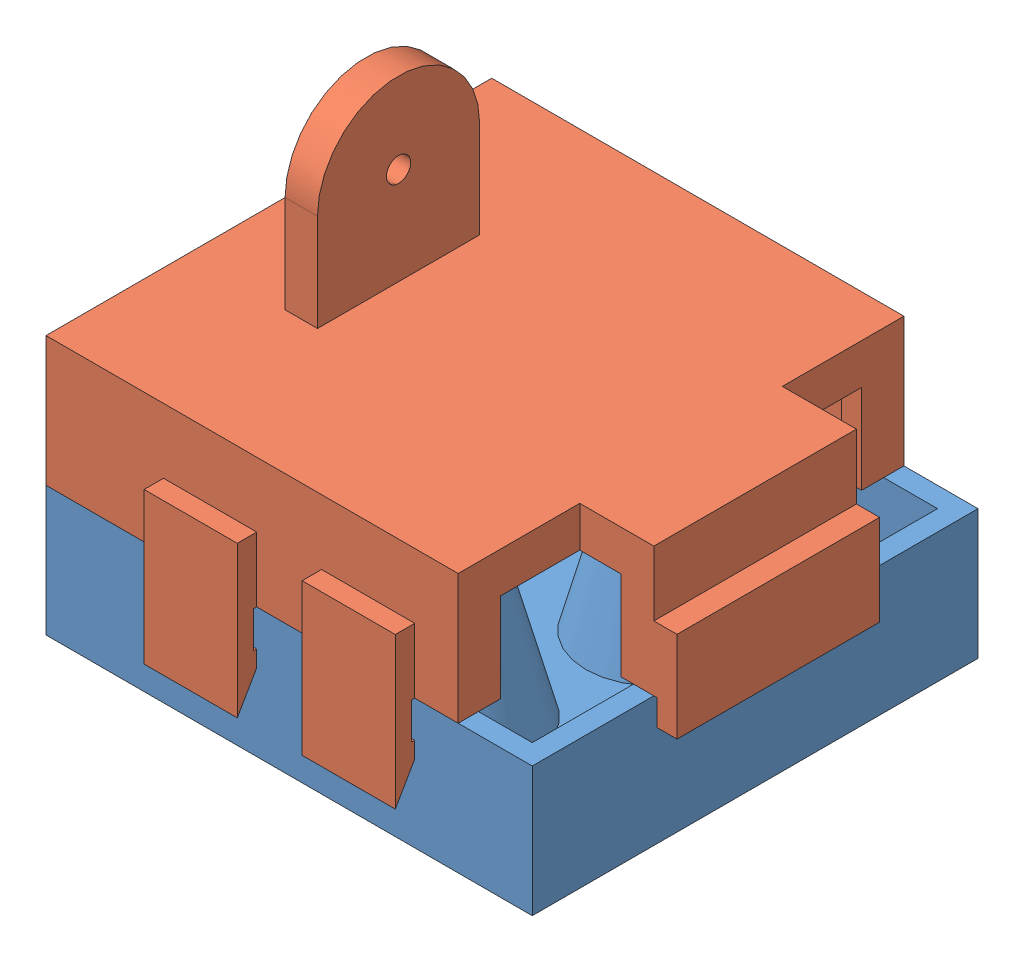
SolidWorks assembly UltrasonicSensorBox.SLDASM, configuration Default (file format 9000). Lengths in mm.
Overall size (62.86 54 59.8).
2 component instances, 2 part files, 3 mates.
Components (placement in the parent):
- BottomBox-1: BottomBox.SLDPRT [Default] at (-34.1 -32.6165 42.4341) size (60 24.5 56)
- TopCover-1: TopCover.sldprt [Default] at (2.5 -3.1165 -2.5) x (0 0 -1) z (1 0 0) size (59.8 48.66 62.86)
Mates (geometry in assembly coordinates):
- Coincident4: coincident aligned: plane of BottomBox-1 through (-60.4578 -30.1165 1.2281) normal (0 0 -1); plane of TopCover-1 through (-60.4578 -0.6165 1.2281) normal (0 0 -1)
- Coincident5: coincident aligned: plane of BottomBox-1 through (-60.4578 -30.1165 1.2281) normal (-1 0 0); plane of TopCover-1 through (-60.4578 -0.6165 56.2281) normal (-1 0 0)
- Coincident6: coincident anti-aligned: plane of BottomBox-1 through (-34.1 -16.6165 42.4341) normal (0 1 0); plane of TopCover-1 through (2.5 -16.6165 -2.5) normal (0 -1 0)
